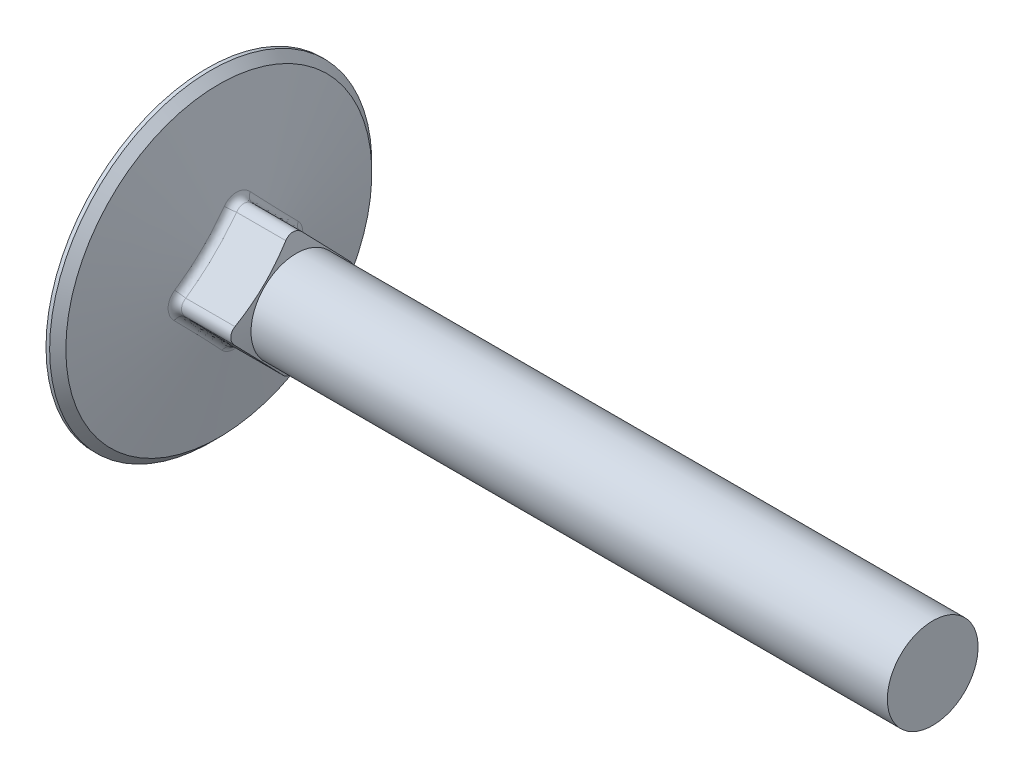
from build123d import *

# Parameters (mm, degrees)
NECK_DEPTH   = 9.3726
HEADFILLET_R = 0.7874


with BuildPart() as part:
    # BodySke → BaseBody (revolve)
    with BuildSketch(Plane.XY, mode=Mode.PRIVATE) as basebody_sk:
        Polygon((0, 0), (0, 16.9164), (0.381, 16.9164), (1.231924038, 16.065475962), (3.429, 4.7625), (76.2, 4.7625), (76.2, 0), align=None)
    revolve(basebody_sk.sketch.rotate(Axis((-6.35, 0, 0), (1, 0, 0)), 90), axis=Axis((-6.35, 0, 0), (1, 0, 0)))

    # Sketch2 → Neck (add)
    with BuildSketch(Plane(origin=(0, 0, 0), x_dir=(0, 0.6946583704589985, -0.7193398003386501), z_dir=(1, 0, 0))):
        with BuildLine():
            Line((3.7084, -4.9022), (-3.7084, -4.9022))
            ThreePointArc((-3.7084, -4.9022), (-4.552544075, -4.552544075), (-4.9022, -3.7084))
            Line((-4.9022, -3.7084), (-4.9022, 3.7084))
            ThreePointArc((-4.9022, 3.7084), (-4.552544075, 4.552544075), (-3.7084, 4.9022))
            Line((-3.7084, 4.9022), (3.7084, 4.9022))
            ThreePointArc((3.7084, 4.9022), (4.552544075, 4.552544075), (4.9022, 3.7084))
            Line((4.9022, 3.7084), (4.9022, -3.7084))
            ThreePointArc((4.9022, -3.7084), (4.552544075, -4.552544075), (3.7084, -4.9022))
        make_face()
    extrude(amount=NECK_DEPTH)

    # Sketch3 → NeckChamfer (revolve, cut)
    with BuildSketch(Plane.XY, mode=Mode.PRIVATE) as neckchamfer_sk:
        Polygon((2.713017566, 29.6164), (9.3726, 4.7625), (9.6266, 4.7625), (9.6266, 29.6164), align=None)
    revolve(neckchamfer_sk.sketch.rotate(Axis((0, 0, 0), (1, 0, 0)), 90), axis=Axis((0, 0, 0), (1, 0, 0)), mode=Mode.SUBTRACT)

    # HeadFillet
    headfillet_edges = [part.edges().sort_by_distance(p)[0] for p in [
        (3.401845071, 3.405354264, -3.526347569),
        (3.103263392, -0.112363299, -6.437288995),
        (3.401845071, -3.526347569, -3.405354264),
        (3.103263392, -6.437288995, 0.112363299),
        (3.401845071, -3.405354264, 3.526347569),
        (3.121431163, -0.398458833, 6.332280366),
        (3.401845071, 3.526347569, 3.405354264),
        (3.103263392, 6.437288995, -0.112363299),
    ]]
    fillet(headfillet_edges, radius=HEADFILLET_R)


solid = part.part
